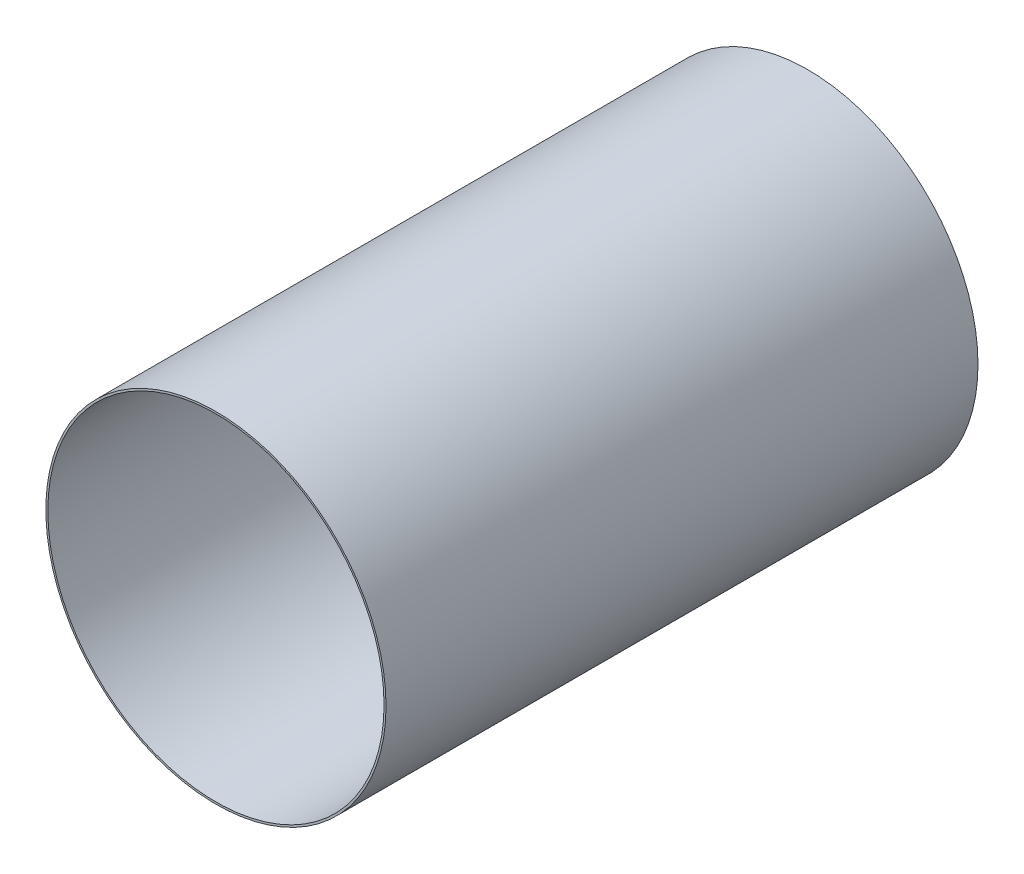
ISO-10303-21;
HEADER;
FILE_DESCRIPTION(('STEP AP214'),'2;1');
FILE_NAME('part.step','',(''),(''),'','','');
FILE_SCHEMA(('AUTOMOTIVE_DESIGN { 1 0 10303 214 1 1 1 1 }'));
ENDSEC;
DATA;
#1=APPLICATION_CONTEXT('core data for automotive mechanical design processes');
#2=APPLICATION_PROTOCOL_DEFINITION('international standard','automotive_design',2000,#1);
#3=PRODUCT_CONTEXT('',#1,'mechanical');
#4=PRODUCT('Part','Part','',(#3));
#5=PRODUCT_RELATED_PRODUCT_CATEGORY('part','',(#4));
#6=PRODUCT_DEFINITION_FORMATION('','',#4);
#7=PRODUCT_DEFINITION_CONTEXT('part definition',#1,'design');
#8=PRODUCT_DEFINITION('design','',#6,#7);
#9=PRODUCT_DEFINITION_SHAPE('','',#8);
#10=(LENGTH_UNIT() NAMED_UNIT(*) SI_UNIT(.MILLI.,.METRE.));
#11=(NAMED_UNIT(*) PLANE_ANGLE_UNIT() SI_UNIT($,.RADIAN.));
#12=(NAMED_UNIT(*) SI_UNIT($,.STERADIAN.) SOLID_ANGLE_UNIT());
#13=UNCERTAINTY_MEASURE_WITH_UNIT(LENGTH_MEASURE(1.E-05),#10,'distance_accuracy_value','');
#14=(GEOMETRIC_REPRESENTATION_CONTEXT(3) GLOBAL_UNCERTAINTY_ASSIGNED_CONTEXT((#13)) GLOBAL_UNIT_ASSIGNED_CONTEXT((#10,
#11,#12)) REPRESENTATION_CONTEXT('',''));
#15=CARTESIAN_POINT('',(0.,0.,0.));
#16=DIRECTION('',(0.,0.,1.));
#17=DIRECTION('',(1.,0.,0.));
#18=AXIS2_PLACEMENT_3D('',#15,#16,#17);
#19=CARTESIAN_POINT('',(0.,0.,3000.));
#20=DIRECTION('',(0.,0.,1.));
#21=DIRECTION('',(1.,0.,0.));
#22=AXIS2_PLACEMENT_3D('',#19,#20,#21);
#23=PLANE('',#22);
#24=CARTESIAN_POINT('',(0.,0.,3000.));
#25=DIRECTION('',(0.,0.,1.));
#26=DIRECTION('',(1.,0.,0.));
#27=AXIS2_PLACEMENT_3D('',#24,#25,#26);
#28=CIRCLE('',#27,1723.9);
#29=CARTESIAN_POINT('',(1723.9,0.,3000.));
#30=VERTEX_POINT('',#29);
#31=EDGE_CURVE('E10',#30,#30,#28,.T.);
#32=ORIENTED_EDGE('',*,*,#31,.T.);
#33=EDGE_LOOP('',(#32));
#34=FACE_BOUND('',#33,.T.);
#35=CARTESIAN_POINT('',(0.,0.,3000.));
#36=DIRECTION('',(0.,0.,1.));
#37=DIRECTION('',(1.,0.,0.));
#38=AXIS2_PLACEMENT_3D('',#35,#36,#37);
#39=CIRCLE('',#38,1703.9);
#40=CARTESIAN_POINT('',(1703.9,0.,3000.));
#41=VERTEX_POINT('',#40);
#42=EDGE_CURVE('E50',#41,#41,#39,.T.);
#43=ORIENTED_EDGE('',*,*,#42,.F.);
#44=EDGE_LOOP('',(#43));
#45=FACE_BOUND('',#44,.T.);
#46=ADVANCED_FACE('F37',(#34,#45),#23,.T.);
#47=CARTESIAN_POINT('',(0.,0.,-3000.));
#48=DIRECTION('',(0.,0.,1.));
#49=DIRECTION('',(1.,0.,0.));
#50=AXIS2_PLACEMENT_3D('',#47,#48,#49);
#51=PLANE('',#50);
#52=CARTESIAN_POINT('',(0.,0.,-3000.));
#53=DIRECTION('',(0.,0.,1.));
#54=DIRECTION('',(1.,0.,0.));
#55=AXIS2_PLACEMENT_3D('',#52,#53,#54);
#56=CIRCLE('',#55,1723.9);
#57=CARTESIAN_POINT('',(1723.9,0.,-3000.));
#58=VERTEX_POINT('',#57);
#59=EDGE_CURVE('E41',#58,#58,#56,.T.);
#60=ORIENTED_EDGE('',*,*,#59,.F.);
#61=EDGE_LOOP('',(#60));
#62=FACE_BOUND('',#61,.T.);
#63=CARTESIAN_POINT('',(0.,0.,-3000.));
#64=DIRECTION('',(0.,0.,1.));
#65=DIRECTION('',(1.,0.,0.));
#66=AXIS2_PLACEMENT_3D('',#63,#64,#65);
#67=CIRCLE('',#66,1703.9);
#68=CARTESIAN_POINT('',(1703.9,0.,-3000.));
#69=VERTEX_POINT('',#68);
#70=EDGE_CURVE('E52',#69,#69,#67,.T.);
#71=ORIENTED_EDGE('',*,*,#70,.T.);
#72=EDGE_LOOP('',(#71));
#73=FACE_BOUND('',#72,.T.);
#74=ADVANCED_FACE('F64',(#62,#73),#51,.F.);
#75=CARTESIAN_POINT('',(0.,0.,3000.));
#76=DIRECTION('',(0.,0.,-1.));
#77=DIRECTION('',(-1.,0.,0.));
#78=AXIS2_PLACEMENT_3D('',#75,#76,#77);
#79=CYLINDRICAL_SURFACE('',#78,1723.9);
#80=ORIENTED_EDGE('',*,*,#31,.F.);
#81=EDGE_LOOP('',(#80));
#82=FACE_BOUND('',#81,.T.);
#83=ORIENTED_EDGE('',*,*,#59,.T.);
#84=EDGE_LOOP('',(#83));
#85=FACE_BOUND('',#84,.T.);
#86=ADVANCED_FACE('F39',(#82,#85),#79,.T.);
#87=CARTESIAN_POINT('',(0.,0.,3000.));
#88=DIRECTION('',(0.,0.,-1.));
#89=DIRECTION('',(-1.,0.,0.));
#90=AXIS2_PLACEMENT_3D('',#87,#88,#89);
#91=CYLINDRICAL_SURFACE('',#90,1703.9);
#92=ORIENTED_EDGE('',*,*,#42,.T.);
#93=EDGE_LOOP('',(#92));
#94=FACE_BOUND('',#93,.T.);
#95=ORIENTED_EDGE('',*,*,#70,.F.);
#96=EDGE_LOOP('',(#95));
#97=FACE_BOUND('',#96,.T.);
#98=ADVANCED_FACE('F60',(#94,#97),#91,.F.);
#99=CLOSED_SHELL('',(#46,#74,#86,#98));
#100=MANIFOLD_SOLID_BREP('B2',#99);
#101=ADVANCED_BREP_SHAPE_REPRESENTATION('',(#18,#100),#14);
#102=SHAPE_DEFINITION_REPRESENTATION(#9,#101);
ENDSEC;
END-ISO-10303-21;
